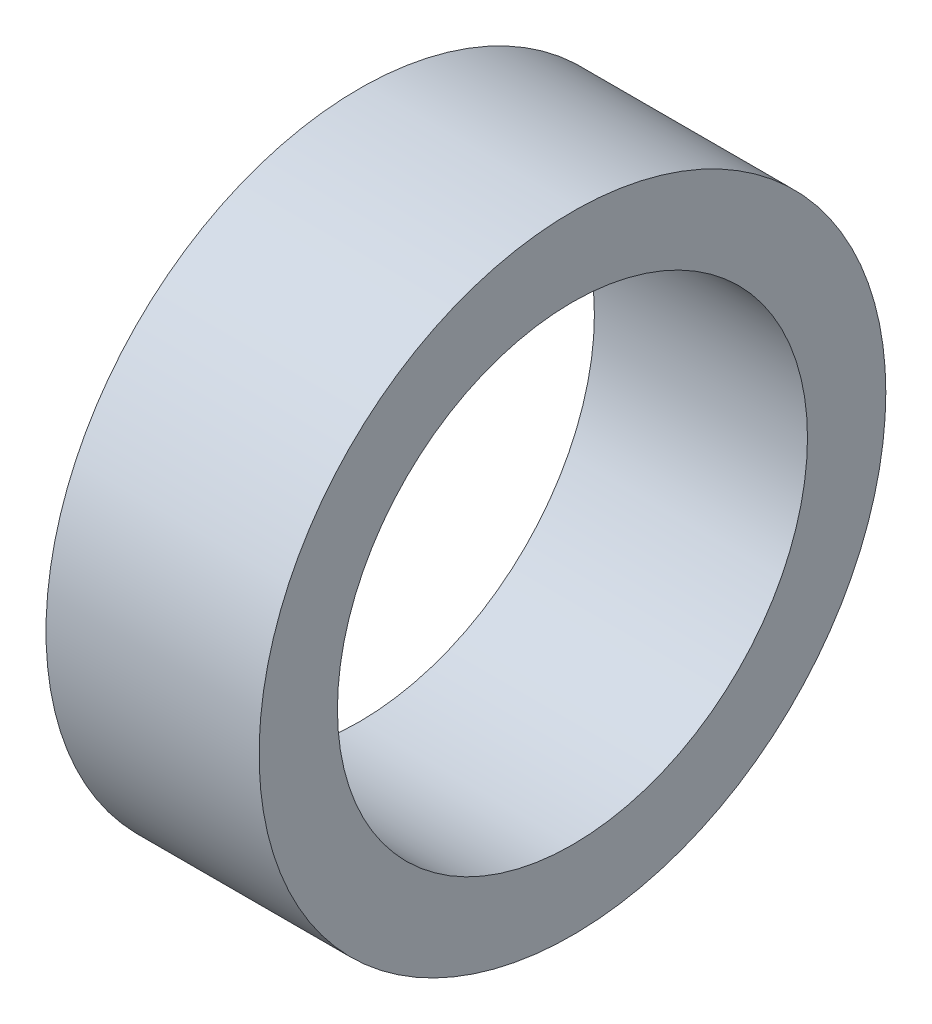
from build123d import *

# Parameters (mm, degrees)
SKETCH1_R           = 10
SKETCH1_R_2         = 7.5
BOSS_EXTRUDE1_DEPTH = 6.8


with BuildPart() as part:
    # Sketch1 → Boss-Extrude1 (new body)
    with BuildSketch(Plane(origin=(0, 0, 0), x_dir=(0, 0, -1), z_dir=(1, 0, 0))):
        Circle(SKETCH1_R)
        Circle(SKETCH1_R_2, mode=Mode.SUBTRACT)
    extrude(amount=BOSS_EXTRUDE1_DEPTH)


solid = part.part
